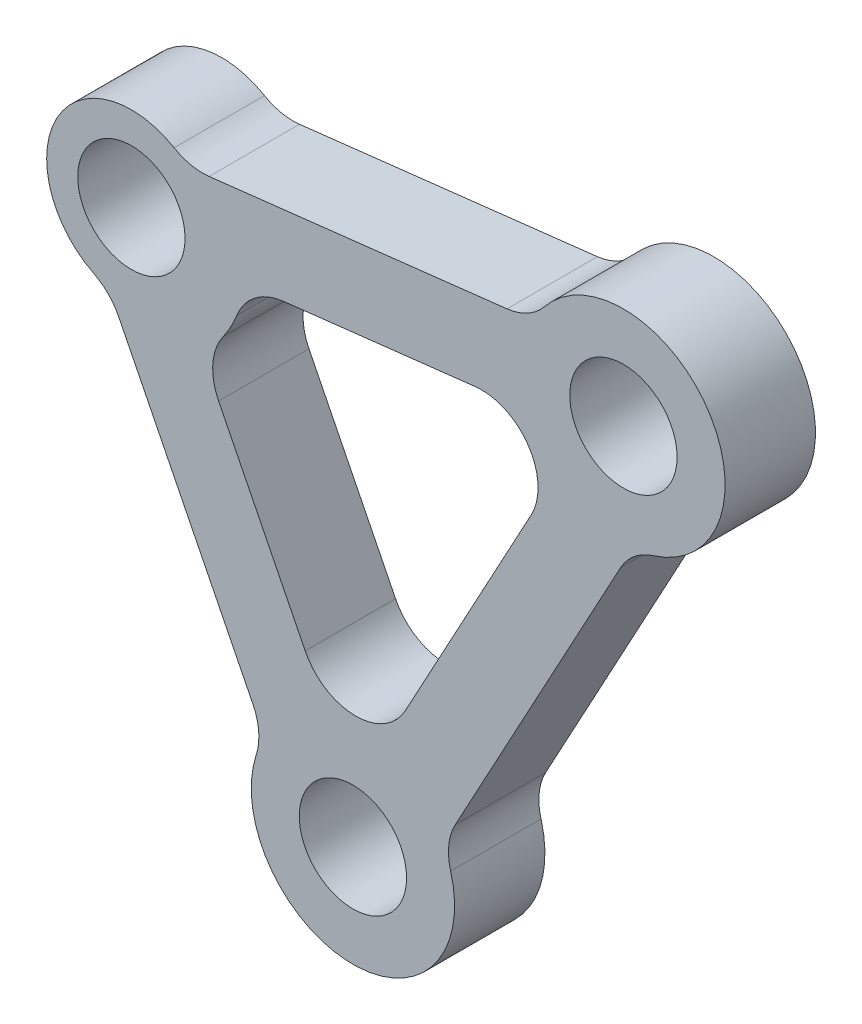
ISO-10303-21;
HEADER;
FILE_DESCRIPTION(('STEP AP214'),'2;1');
FILE_NAME('part.step','',(''),(''),'','','');
FILE_SCHEMA(('AUTOMOTIVE_DESIGN { 1 0 10303 214 1 1 1 1 }'));
ENDSEC;
DATA;
#1=APPLICATION_CONTEXT('core data for automotive mechanical design processes');
#2=APPLICATION_PROTOCOL_DEFINITION('international standard','automotive_design',2000,#1);
#3=PRODUCT_CONTEXT('',#1,'mechanical');
#4=PRODUCT('Part','Part','',(#3));
#5=PRODUCT_RELATED_PRODUCT_CATEGORY('part','',(#4));
#6=PRODUCT_DEFINITION_FORMATION('','',#4);
#7=PRODUCT_DEFINITION_CONTEXT('part definition',#1,'design');
#8=PRODUCT_DEFINITION('design','',#6,#7);
#9=PRODUCT_DEFINITION_SHAPE('','',#8);
#10=(LENGTH_UNIT() NAMED_UNIT(*) SI_UNIT(.MILLI.,.METRE.));
#11=(NAMED_UNIT(*) PLANE_ANGLE_UNIT() SI_UNIT($,.RADIAN.));
#12=(NAMED_UNIT(*) SI_UNIT($,.STERADIAN.) SOLID_ANGLE_UNIT());
#13=UNCERTAINTY_MEASURE_WITH_UNIT(LENGTH_MEASURE(1.E-05),#10,'distance_accuracy_value','');
#14=(GEOMETRIC_REPRESENTATION_CONTEXT(3) GLOBAL_UNCERTAINTY_ASSIGNED_CONTEXT((#13)) GLOBAL_UNIT_ASSIGNED_CONTEXT((#10,
#11,#12)) REPRESENTATION_CONTEXT('',''));
#15=CARTESIAN_POINT('',(0.,0.,0.));
#16=DIRECTION('',(0.,0.,1.));
#17=DIRECTION('',(1.,0.,0.));
#18=AXIS2_PLACEMENT_3D('',#15,#16,#17);
#19=CARTESIAN_POINT('',(24.01885053,220.145067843,29.));
#20=DIRECTION('',(0.11438469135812,-0.993436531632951,0.));
#21=DIRECTION('',(0.993436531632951,0.11438469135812,0.));
#22=AXIS2_PLACEMENT_3D('',#19,#20,#21);
#23=PLANE('',#22);
#24=DIRECTION('',(0.,0.,1.));
#25=VECTOR('',#24,1.);
#26=CARTESIAN_POINT('',(24.0188505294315,220.145067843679,33.));
#27=LINE('',#26,#25);
#28=CARTESIAN_POINT('',(24.0188505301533,220.14506784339,37.));
#29=VERTEX_POINT('',#28);
#30=CARTESIAN_POINT('',(24.018850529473,220.145067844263,29.));
#31=VERTEX_POINT('',#30);
#32=EDGE_CURVE('E309',#29,#31,#27,.F.);
#33=ORIENTED_EDGE('',*,*,#32,.F.);
#34=DIRECTION('',(0.993436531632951,0.11438469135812,0.));
#35=VECTOR('',#34,1.);
#36=CARTESIAN_POINT('',(24.01885053,220.145067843,37.));
#37=LINE('',#36,#35);
#38=CARTESIAN_POINT('',(50.3943201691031,223.181950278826,37.));
#39=VERTEX_POINT('',#38);
#40=EDGE_CURVE('E259',#29,#39,#37,.T.);
#41=ORIENTED_EDGE('',*,*,#40,.T.);
#42=DIRECTION('',(0.,0.,-1.));
#43=VECTOR('',#42,1.);
#44=CARTESIAN_POINT('',(50.3943201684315,223.181950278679,33.));
#45=LINE('',#44,#43);
#46=CARTESIAN_POINT('',(50.3943201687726,223.181950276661,29.));
#47=VERTEX_POINT('',#46);
#48=EDGE_CURVE('E203',#47,#39,#45,.F.);
#49=ORIENTED_EDGE('',*,*,#48,.F.);
#50=DIRECTION('',(0.993436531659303,0.114384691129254,0.));
#51=VECTOR('',#50,1.);
#52=CARTESIAN_POINT('',(24.018850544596,220.145067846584,29.));
#53=LINE('',#52,#51);
#54=EDGE_CURVE('E291',#31,#47,#53,.T.);
#55=ORIENTED_EDGE('',*,*,#54,.F.);
#56=EDGE_LOOP('',(#33,#41,#49,#55));
#57=FACE_BOUND('',#56,.T.);
#58=ADVANCED_FACE('F30',(#57),#23,.F.);
#59=CARTESIAN_POINT('',(49.822396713,228.149132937,37.));
#60=DIRECTION('',(0.,0.,-1.));
#61=DIRECTION('',(-1.,0.,0.));
#62=AXIS2_PLACEMENT_3D('',#59,#60,#61);
#63=CYLINDRICAL_SURFACE('',#62,5.);
#64=CARTESIAN_POINT('',(49.822396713,228.149132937,37.));
#65=DIRECTION('',(0.,0.,-1.));
#66=DIRECTION('',(-1.,0.,0.));
#67=AXIS2_PLACEMENT_3D('',#64,#65,#66);
#68=CIRCLE('',#67,5.);
#69=CARTESIAN_POINT('',(53.707217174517,225.001408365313,37.));
#70=VERTEX_POINT('',#69);
#71=EDGE_CURVE('E256',#39,#70,#68,.F.);
#72=ORIENTED_EDGE('',*,*,#71,.T.);
#73=DIRECTION('',(0.,0.,1.));
#74=VECTOR('',#73,1.);
#75=CARTESIAN_POINT('',(53.7072171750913,225.001408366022,33.));
#76=LINE('',#75,#74);
#77=CARTESIAN_POINT('',(53.7072171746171,225.001408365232,29.));
#78=VERTEX_POINT('',#77);
#79=EDGE_CURVE('E200',#70,#78,#76,.F.);
#80=ORIENTED_EDGE('',*,*,#79,.T.);
#81=CARTESIAN_POINT('',(49.822396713,228.149132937,29.));
#82=DIRECTION('',(0.,0.,-1.));
#83=DIRECTION('',(-1.,0.,0.));
#84=AXIS2_PLACEMENT_3D('',#81,#82,#83);
#85=CIRCLE('',#84,5.);
#86=EDGE_CURVE('E290',#47,#78,#85,.F.);
#87=ORIENTED_EDGE('',*,*,#86,.F.);
#88=ORIENTED_EDGE('',*,*,#48,.T.);
#89=EDGE_LOOP('',(#72,#80,#87,#88));
#90=FACE_BOUND('',#89,.T.);
#91=ADVANCED_FACE('F342',(#90),#63,.F.);
#92=CARTESIAN_POINT('',(60.699894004,219.335504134,37.));
#93=DIRECTION('',(0.,0.,-1.));
#94=DIRECTION('',(-1.,0.,0.));
#95=AXIS2_PLACEMENT_3D('',#92,#93,#94);
#96=CYLINDRICAL_SURFACE('',#95,8.99999999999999);
#97=ORIENTED_EDGE('',*,*,#79,.F.);
#98=CARTESIAN_POINT('',(60.699894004,219.335504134,37.));
#99=DIRECTION('',(0.,0.,-1.));
#100=DIRECTION('',(-1.,0.,0.));
#101=AXIS2_PLACEMENT_3D('',#98,#99,#100);
#102=CIRCLE('',#101,8.99999999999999);
#103=CARTESIAN_POINT('',(63.3541871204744,210.735810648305,37.));
#104=VERTEX_POINT('',#103);
#105=EDGE_CURVE('E253',#70,#104,#102,.T.);
#106=ORIENTED_EDGE('',*,*,#105,.T.);
#107=DIRECTION('',(0.,0.,-1.));
#108=VECTOR('',#107,1.);
#109=CARTESIAN_POINT('',(63.3541871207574,210.735810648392,33.));
#110=LINE('',#109,#108);
#111=CARTESIAN_POINT('',(63.3541871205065,210.7358106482,29.));
#112=VERTEX_POINT('',#111);
#113=EDGE_CURVE('E198',#112,#104,#110,.F.);
#114=ORIENTED_EDGE('',*,*,#113,.F.);
#115=CARTESIAN_POINT('',(60.699894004,219.335504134,29.));
#116=DIRECTION('',(0.,0.,-1.));
#117=DIRECTION('',(-1.,0.,0.));
#118=AXIS2_PLACEMENT_3D('',#115,#116,#117);
#119=CIRCLE('',#118,8.99999999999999);
#120=EDGE_CURVE('E288',#78,#112,#119,.T.);
#121=ORIENTED_EDGE('',*,*,#120,.F.);
#122=EDGE_LOOP('',(#97,#106,#114,#121));
#123=FACE_BOUND('',#122,.T.);
#124=ADVANCED_FACE('F347',(#123),#96,.T.);
#125=CARTESIAN_POINT('',(64.828794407,205.958203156,37.));
#126=DIRECTION('',(0.,0.,-1.));
#127=DIRECTION('',(-1.,0.,0.));
#128=AXIS2_PLACEMENT_3D('',#125,#126,#127);
#129=CYLINDRICAL_SURFACE('',#128,4.99999999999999);
#130=CARTESIAN_POINT('',(64.828794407,205.958203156,37.));
#131=DIRECTION('',(0.,0.,-1.));
#132=DIRECTION('',(-1.,0.,0.));
#133=AXIS2_PLACEMENT_3D('',#130,#131,#132);
#134=CIRCLE('',#133,4.99999999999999);
#135=CARTESIAN_POINT('',(60.4318747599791,208.338769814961,37.));
#136=VERTEX_POINT('',#135);
#137=EDGE_CURVE('E250',#104,#136,#134,.F.);
#138=ORIENTED_EDGE('',*,*,#137,.T.);
#139=DIRECTION('',(0.,0.,-1.));
#140=VECTOR('',#139,1.);
#141=CARTESIAN_POINT('',(60.43187476,208.338769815,33.));
#142=LINE('',#141,#140);
#143=CARTESIAN_POINT('',(60.4318747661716,208.338769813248,29.));
#144=VERTEX_POINT('',#143);
#145=EDGE_CURVE('E192',#136,#144,#142,.T.);
#146=ORIENTED_EDGE('',*,*,#145,.T.);
#147=CARTESIAN_POINT('',(64.828794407,205.958203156,29.));
#148=DIRECTION('',(0.,0.,-1.));
#149=DIRECTION('',(-1.,0.,0.));
#150=AXIS2_PLACEMENT_3D('',#147,#148,#149);
#151=CIRCLE('',#150,4.99999999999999);
#152=EDGE_CURVE('E286',#112,#144,#151,.F.);
#153=ORIENTED_EDGE('',*,*,#152,.F.);
#154=ORIENTED_EDGE('',*,*,#113,.T.);
#155=EDGE_LOOP('',(#138,#146,#153,#154));
#156=FACE_BOUND('',#155,.T.);
#157=ADVANCED_FACE('F350',(#156),#129,.F.);
#158=CARTESIAN_POINT('',(60.43187476,208.338769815,29.));
#159=DIRECTION('',(-0.879383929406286,0.476113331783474,0.));
#160=DIRECTION('',(-0.476113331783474,-0.879383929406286,0.));
#161=AXIS2_PLACEMENT_3D('',#158,#159,#160);
#162=PLANE('',#161);
#163=ORIENTED_EDGE('',*,*,#145,.F.);
#164=DIRECTION('',(-0.476113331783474,-0.879383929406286,0.));
#165=VECTOR('',#164,1.);
#166=CARTESIAN_POINT('',(60.43187476,208.338769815,37.));
#167=LINE('',#166,#165);
#168=CARTESIAN_POINT('',(45.813251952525,181.338093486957,37.));
#169=VERTEX_POINT('',#168);
#170=EDGE_CURVE('E247',#136,#169,#167,.T.);
#171=ORIENTED_EDGE('',*,*,#170,.T.);
#172=DIRECTION('',(0.,0.,-1.));
#173=VECTOR('',#172,1.);
#174=CARTESIAN_POINT('',(45.8132519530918,181.338093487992,33.));
#175=LINE('',#174,#173);
#176=CARTESIAN_POINT('',(45.8132519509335,181.338093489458,29.));
#177=VERTEX_POINT('',#176);
#178=EDGE_CURVE('E188',#177,#169,#175,.F.);
#179=ORIENTED_EDGE('',*,*,#178,.F.);
#180=DIRECTION('',(-0.476113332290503,-0.879383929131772,0.));
#181=VECTOR('',#180,1.);
#182=CARTESIAN_POINT('',(60.4318747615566,208.338769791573,29.));
#183=LINE('',#182,#181);
#184=EDGE_CURVE('E169',#144,#177,#183,.T.);
#185=ORIENTED_EDGE('',*,*,#184,.F.);
#186=EDGE_LOOP('',(#163,#171,#179,#185));
#187=FACE_BOUND('',#186,.T.);
#188=ADVANCED_FACE('F353',(#187),#162,.F.);
#189=CARTESIAN_POINT('',(50.210171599,178.957526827,37.));
#190=DIRECTION('',(0.,0.,-1.));
#191=DIRECTION('',(-1.,0.,0.));
#192=AXIS2_PLACEMENT_3D('',#189,#190,#191);
#193=CYLINDRICAL_SURFACE('',#192,5.);
#194=CARTESIAN_POINT('',(50.210171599,178.957526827,29.));
#195=DIRECTION('',(0.,0.,-1.));
#196=DIRECTION('',(-1.,0.,0.));
#197=AXIS2_PLACEMENT_3D('',#194,#195,#196);
#198=CIRCLE('',#197,5.);
#199=CARTESIAN_POINT('',(45.4034651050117,177.58072884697,29.));
#200=VERTEX_POINT('',#199);
#201=EDGE_CURVE('E162',#177,#200,#198,.F.);
#202=ORIENTED_EDGE('',*,*,#201,.F.);
#203=ORIENTED_EDGE('',*,*,#178,.T.);
#204=CARTESIAN_POINT('',(50.210171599,178.957526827,37.));
#205=DIRECTION('',(0.,0.,-1.));
#206=DIRECTION('',(-1.,0.,0.));
#207=AXIS2_PLACEMENT_3D('',#204,#205,#206);
#208=CIRCLE('',#207,5.);
#209=CARTESIAN_POINT('',(45.4034651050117,177.58072884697,37.));
#210=VERTEX_POINT('',#209);
#211=EDGE_CURVE('E186',#169,#210,#208,.F.);
#212=ORIENTED_EDGE('',*,*,#211,.T.);
#213=DIRECTION('',(0.,0.,1.));
#214=VECTOR('',#213,1.);
#215=CARTESIAN_POINT('',(45.4034651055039,177.580728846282,33.));
#216=LINE('',#215,#214);
#217=EDGE_CURVE('E178',#210,#200,#216,.F.);
#218=ORIENTED_EDGE('',*,*,#217,.T.);
#219=EDGE_LOOP('',(#202,#203,#212,#218));
#220=FACE_BOUND('',#219,.T.);
#221=ADVANCED_FACE('F184',(#220),#193,.F.);
#222=CARTESIAN_POINT('',(36.751393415,175.102492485,37.));
#223=DIRECTION('',(0.,0.,-1.));
#224=DIRECTION('',(-1.,0.,0.));
#225=AXIS2_PLACEMENT_3D('',#222,#223,#224);
#226=CYLINDRICAL_SURFACE('',#225,9.);
#227=CARTESIAN_POINT('',(36.751393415,175.102492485,37.));
#228=DIRECTION('',(0.,0.,-1.));
#229=DIRECTION('',(-1.,0.,0.));
#230=AXIS2_PLACEMENT_3D('',#227,#228,#229);
#231=CIRCLE('',#230,9.);
#232=CARTESIAN_POINT('',(28.1844969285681,177.860804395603,37.));
#233=VERTEX_POINT('',#232);
#234=EDGE_CURVE('E244',#210,#233,#231,.T.);
#235=ORIENTED_EDGE('',*,*,#234,.T.);
#236=DIRECTION('',(0.,0.,-1.));
#237=VECTOR('',#236,1.);
#238=CARTESIAN_POINT('',(28.1844969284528,177.860804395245,33.));
#239=LINE('',#238,#237);
#240=CARTESIAN_POINT('',(28.1844969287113,177.860804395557,29.));
#241=VERTEX_POINT('',#240);
#242=EDGE_CURVE('E179',#241,#233,#239,.F.);
#243=ORIENTED_EDGE('',*,*,#242,.F.);
#244=CARTESIAN_POINT('',(36.751393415,175.102492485,29.));
#245=DIRECTION('',(0.,0.,-1.));
#246=DIRECTION('',(-1.,0.,0.));
#247=AXIS2_PLACEMENT_3D('',#244,#245,#246);
#248=CIRCLE('',#247,9.);
#249=EDGE_CURVE('E166',#200,#241,#248,.T.);
#250=ORIENTED_EDGE('',*,*,#249,.F.);
#251=ORIENTED_EDGE('',*,*,#217,.F.);
#252=EDGE_LOOP('',(#235,#243,#250,#251));
#253=FACE_BOUND('',#252,.T.);
#254=ADVANCED_FACE('F177',(#253),#226,.T.);
#255=CARTESIAN_POINT('',(23.425109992,179.393199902,37.));
#256=DIRECTION('',(0.,0.,-1.));
#257=DIRECTION('',(-1.,0.,0.));
#258=AXIS2_PLACEMENT_3D('',#255,#256,#257);
#259=CYLINDRICAL_SURFACE('',#258,5.);
#260=CARTESIAN_POINT('',(23.425109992,179.393199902,37.));
#261=DIRECTION('',(0.,0.,-1.));
#262=DIRECTION('',(-1.,0.,0.));
#263=AXIS2_PLACEMENT_3D('',#260,#261,#262);
#264=CIRCLE('',#263,5.);
#265=CARTESIAN_POINT('',(27.897125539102,181.629508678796,37.));
#266=VERTEX_POINT('',#265);
#267=EDGE_CURVE('E241',#233,#266,#264,.F.);
#268=ORIENTED_EDGE('',*,*,#267,.T.);
#269=DIRECTION('',(0.,0.,-1.));
#270=VECTOR('',#269,1.);
#271=CARTESIAN_POINT('',(27.897125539,181.629508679,33.));
#272=LINE('',#271,#270);
#273=CARTESIAN_POINT('',(27.8971255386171,181.629508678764,29.));
#274=VERTEX_POINT('',#273);
#275=EDGE_CURVE('E190',#266,#274,#272,.T.);
#276=ORIENTED_EDGE('',*,*,#275,.T.);
#277=CARTESIAN_POINT('',(23.425109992,179.393199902,29.));
#278=DIRECTION('',(0.,0.,-1.));
#279=DIRECTION('',(-1.,0.,0.));
#280=AXIS2_PLACEMENT_3D('',#277,#278,#279);
#281=CIRCLE('',#280,5.);
#282=EDGE_CURVE('E181',#241,#274,#281,.F.);
#283=ORIENTED_EDGE('',*,*,#282,.F.);
#284=ORIENTED_EDGE('',*,*,#242,.T.);
#285=EDGE_LOOP('',(#268,#276,#283,#284));
#286=FACE_BOUND('',#285,.T.);
#287=ADVANCED_FACE('F318',(#286),#259,.F.);
#288=CARTESIAN_POINT('',(27.897125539,181.629508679,29.));
#289=DIRECTION('',(0.894403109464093,0.447261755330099,0.));
#290=DIRECTION('',(-0.447261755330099,0.894403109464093,0.));
#291=AXIS2_PLACEMENT_3D('',#288,#289,#290);
#292=PLANE('',#291);
#293=ORIENTED_EDGE('',*,*,#275,.F.);
#294=DIRECTION('',(-0.447261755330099,0.894403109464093,0.));
#295=VECTOR('',#294,1.);
#296=CARTESIAN_POINT('',(27.897125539,181.629508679,37.));
#297=LINE('',#296,#295);
#298=CARTESIAN_POINT('',(16.0224476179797,205.375667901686,37.));
#299=VERTEX_POINT('',#298);
#300=EDGE_CURVE('E238',#266,#299,#297,.T.);
#301=ORIENTED_EDGE('',*,*,#300,.T.);
#302=DIRECTION('',(0.,0.,-1.));
#303=VECTOR('',#302,1.);
#304=CARTESIAN_POINT('',(16.0224476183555,205.375667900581,33.));
#305=LINE('',#304,#303);
#306=CARTESIAN_POINT('',(16.0224476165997,205.375667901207,29.));
#307=VERTEX_POINT('',#306);
#308=EDGE_CURVE('E314',#307,#299,#305,.F.);
#309=ORIENTED_EDGE('',*,*,#308,.F.);
#310=DIRECTION('',(-0.447261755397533,0.894403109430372,0.));
#311=VECTOR('',#310,1.);
#312=CARTESIAN_POINT('',(27.8971255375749,181.629508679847,29.));
#313=LINE('',#312,#311);
#314=EDGE_CURVE('E282',#274,#307,#313,.T.);
#315=ORIENTED_EDGE('',*,*,#314,.F.);
#316=EDGE_LOOP('',(#293,#301,#309,#315));
#317=FACE_BOUND('',#316,.T.);
#318=ADVANCED_FACE('F323',(#317),#292,.F.);
#319=CARTESIAN_POINT('',(11.55043207,203.139359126,37.));
#320=DIRECTION('',(0.,0.,-1.));
#321=DIRECTION('',(-1.,0.,0.));
#322=AXIS2_PLACEMENT_3D('',#319,#320,#321);
#323=CYLINDRICAL_SURFACE('',#322,5.);
#324=CARTESIAN_POINT('',(11.55043207,203.139359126,37.));
#325=DIRECTION('',(0.,0.,-1.));
#326=DIRECTION('',(-1.,0.,0.));
#327=AXIS2_PLACEMENT_3D('',#324,#325,#326);
#328=CIRCLE('',#327,5.);
#329=CARTESIAN_POINT('',(13.7862592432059,207.611615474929,37.));
#330=VERTEX_POINT('',#329);
#331=EDGE_CURVE('E235',#299,#330,#328,.F.);
#332=ORIENTED_EDGE('',*,*,#331,.T.);
#333=DIRECTION('',(0.,0.,1.));
#334=VECTOR('',#333,1.);
#335=CARTESIAN_POINT('',(13.7862592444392,207.611615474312,33.));
#336=LINE('',#335,#334);
#337=CARTESIAN_POINT('',(13.7862592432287,207.611615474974,29.));
#338=VERTEX_POINT('',#337);
#339=EDGE_CURVE('E310',#330,#338,#336,.F.);
#340=ORIENTED_EDGE('',*,*,#339,.T.);
#341=CARTESIAN_POINT('',(11.55043207,203.139359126,29.));
#342=DIRECTION('',(0.,0.,-1.));
#343=DIRECTION('',(-1.,0.,0.));
#344=AXIS2_PLACEMENT_3D('',#341,#342,#343);
#345=CIRCLE('',#344,5.);
#346=EDGE_CURVE('E280',#307,#338,#345,.F.);
#347=ORIENTED_EDGE('',*,*,#346,.F.);
#348=ORIENTED_EDGE('',*,*,#308,.T.);
#349=EDGE_LOOP('',(#332,#340,#347,#348));
#350=FACE_BOUND('',#349,.T.);
#351=ADVANCED_FACE('F327',(#350),#323,.F.);
#352=CARTESIAN_POINT('',(17.14,214.32,37.));
#353=DIRECTION('',(0.,0.,-1.));
#354=DIRECTION('',(-1.,0.,0.));
#355=AXIS2_PLACEMENT_3D('',#352,#353,#354);
#356=CYLINDRICAL_SURFACE('',#355,7.5);
#357=CARTESIAN_POINT('',(17.14,214.32,37.));
#358=DIRECTION('',(0.,0.,-1.));
#359=DIRECTION('',(-1.,0.,0.));
#360=AXIS2_PLACEMENT_3D('',#357,#358,#359);
#361=CIRCLE('',#360,7.5);
#362=CARTESIAN_POINT('',(20.9241562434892,220.795350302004,37.));
#363=VERTEX_POINT('',#362);
#364=EDGE_CURVE('E232',#330,#363,#361,.T.);
#365=ORIENTED_EDGE('',*,*,#364,.T.);
#366=DIRECTION('',(0.,0.,-1.));
#367=VECTOR('',#366,1.);
#368=CARTESIAN_POINT('',(20.92415624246,220.795350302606,33.));
#369=LINE('',#368,#367);
#370=CARTESIAN_POINT('',(20.9241562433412,220.795350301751,29.));
#371=VERTEX_POINT('',#370);
#372=EDGE_CURVE('E307',#371,#363,#369,.F.);
#373=ORIENTED_EDGE('',*,*,#372,.F.);
#374=CARTESIAN_POINT('',(17.14,214.32,29.));
#375=DIRECTION('',(0.,0.,-1.));
#376=DIRECTION('',(-1.,0.,0.));
#377=AXIS2_PLACEMENT_3D('',#374,#375,#376);
#378=CIRCLE('',#377,7.5);
#379=EDGE_CURVE('E277',#338,#371,#378,.T.);
#380=ORIENTED_EDGE('',*,*,#379,.F.);
#381=ORIENTED_EDGE('',*,*,#339,.F.);
#382=EDGE_LOOP('',(#365,#373,#380,#381));
#383=FACE_BOUND('',#382,.T.);
#384=ADVANCED_FACE('F330',(#383),#356,.T.);
#385=CARTESIAN_POINT('',(23.446927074,225.112250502,37.));
#386=DIRECTION('',(0.,0.,-1.));
#387=DIRECTION('',(-1.,0.,0.));
#388=AXIS2_PLACEMENT_3D('',#385,#386,#387);
#389=CYLINDRICAL_SURFACE('',#388,5.);
#390=CARTESIAN_POINT('',(23.446927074,225.112250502,37.));
#391=DIRECTION('',(0.,0.,-1.));
#392=DIRECTION('',(-1.,0.,0.));
#393=AXIS2_PLACEMENT_3D('',#390,#391,#392);
#394=CIRCLE('',#393,5.);
#395=EDGE_CURVE('E229',#363,#29,#394,.F.);
#396=ORIENTED_EDGE('',*,*,#395,.T.);
#397=ORIENTED_EDGE('',*,*,#32,.T.);
#398=CARTESIAN_POINT('',(23.446927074,225.112250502,29.));
#399=DIRECTION('',(0.,0.,-1.));
#400=DIRECTION('',(-1.,0.,0.));
#401=AXIS2_PLACEMENT_3D('',#398,#399,#400);
#402=CIRCLE('',#401,5.);
#403=EDGE_CURVE('E34',#371,#31,#402,.F.);
#404=ORIENTED_EDGE('',*,*,#403,.F.);
#405=ORIENTED_EDGE('',*,*,#372,.T.);
#406=EDGE_LOOP('',(#396,#397,#404,#405));
#407=FACE_BOUND('',#406,.T.);
#408=ADVANCED_FACE('F333',(#407),#389,.F.);
#409=CARTESIAN_POINT('',(17.14,214.32,29.));
#410=DIRECTION('',(0.,0.,1.));
#411=DIRECTION('',(1.,0.,0.));
#412=AXIS2_PLACEMENT_3D('',#409,#410,#411);
#413=CYLINDRICAL_SURFACE('',#412,10.);
#414=DIRECTION('',(0.,0.,-1.));
#415=VECTOR('',#414,1.);
#416=CARTESIAN_POINT('',(25.2696129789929,208.496822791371,33.));
#417=LINE('',#416,#415);
#418=CARTESIAN_POINT('',(25.2696129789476,208.496822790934,29.));
#419=VERTEX_POINT('',#418);
#420=CARTESIAN_POINT('',(25.2696129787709,208.496822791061,37.));
#421=VERTEX_POINT('',#420);
#422=EDGE_CURVE('E305',#419,#421,#417,.F.);
#423=ORIENTED_EDGE('',*,*,#422,.F.);
#424=CARTESIAN_POINT('',(17.14,214.32,29.));
#425=DIRECTION('',(0.,0.,1.));
#426=DIRECTION('',(1.,0.,0.));
#427=AXIS2_PLACEMENT_3D('',#424,#425,#426);
#428=CIRCLE('',#427,10.);
#429=CARTESIAN_POINT('',(26.4600785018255,210.695619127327,29.));
#430=VERTEX_POINT('',#429);
#431=EDGE_CURVE('E272',#430,#419,#428,.F.);
#432=ORIENTED_EDGE('',*,*,#431,.F.);
#433=DIRECTION('',(0.,0.,1.));
#434=VECTOR('',#433,1.);
#435=CARTESIAN_POINT('',(26.4600785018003,210.695619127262,33.));
#436=LINE('',#435,#434);
#437=CARTESIAN_POINT('',(26.4600785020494,210.695619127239,37.));
#438=VERTEX_POINT('',#437);
#439=EDGE_CURVE('E295',#438,#430,#436,.F.);
#440=ORIENTED_EDGE('',*,*,#439,.F.);
#441=CARTESIAN_POINT('',(17.14,214.32,37.));
#442=DIRECTION('',(0.,0.,1.));
#443=DIRECTION('',(1.,0.,0.));
#444=AXIS2_PLACEMENT_3D('',#441,#442,#443);
#445=CIRCLE('',#444,10.);
#446=EDGE_CURVE('E223',#438,#421,#445,.F.);
#447=ORIENTED_EDGE('',*,*,#446,.T.);
#448=EDGE_LOOP('',(#423,#432,#440,#447));
#449=FACE_BOUND('',#448,.T.);
#450=ADVANCED_FACE('F400',(#449),#413,.T.);
#451=CARTESIAN_POINT('',(29.334419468,205.585234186,29.));
#452=DIRECTION('',(0.,0.,1.));
#453=DIRECTION('',(1.,0.,0.));
#454=AXIS2_PLACEMENT_3D('',#451,#452,#453);
#455=CYLINDRICAL_SURFACE('',#454,5.);
#456=CARTESIAN_POINT('',(29.334419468,205.585234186,29.));
#457=DIRECTION('',(0.,0.,1.));
#458=DIRECTION('',(1.,0.,0.));
#459=AXIS2_PLACEMENT_3D('',#456,#457,#458);
#460=CIRCLE('',#459,5.);
#461=CARTESIAN_POINT('',(24.8624039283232,203.348925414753,29.));
#462=VERTEX_POINT('',#461);
#463=EDGE_CURVE('E270',#419,#462,#460,.T.);
#464=ORIENTED_EDGE('',*,*,#463,.F.);
#465=ORIENTED_EDGE('',*,*,#422,.T.);
#466=CARTESIAN_POINT('',(29.334419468,205.585234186,37.));
#467=DIRECTION('',(0.,0.,1.));
#468=DIRECTION('',(1.,0.,0.));
#469=AXIS2_PLACEMENT_3D('',#466,#467,#468);
#470=CIRCLE('',#469,5.);
#471=CARTESIAN_POINT('',(24.862403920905,203.34892540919,37.));
#472=VERTEX_POINT('',#471);
#473=EDGE_CURVE('E220',#421,#472,#470,.T.);
#474=ORIENTED_EDGE('',*,*,#473,.T.);
#475=DIRECTION('',(0.,0.,-1.));
#476=VECTOR('',#475,1.);
#477=CARTESIAN_POINT('',(24.862403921,203.348925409,33.));
#478=LINE('',#477,#476);
#479=EDGE_CURVE('E431',#472,#462,#478,.T.);
#480=ORIENTED_EDGE('',*,*,#479,.T.);
#481=EDGE_LOOP('',(#464,#465,#474,#480));
#482=FACE_BOUND('',#481,.T.);
#483=ADVANCED_FACE('F403',(#482),#455,.F.);
#484=CARTESIAN_POINT('',(24.862403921,203.348925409,29.));
#485=DIRECTION('',(-0.894403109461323,-0.447261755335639,0.));
#486=DIRECTION('',(0.447261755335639,-0.894403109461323,0.));
#487=AXIS2_PLACEMENT_3D('',#484,#485,#486);
#488=PLANE('',#487);
#489=DIRECTION('',(0.,0.,-1.));
#490=VECTOR('',#489,1.);
#491=CARTESIAN_POINT('',(32.5259267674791,188.02394270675,33.));
#492=LINE('',#491,#490);
#493=CARTESIAN_POINT('',(32.5259267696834,188.023942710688,29.));
#494=VERTEX_POINT('',#493);
#495=CARTESIAN_POINT('',(32.5259267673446,188.023942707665,37.));
#496=VERTEX_POINT('',#495);
#497=EDGE_CURVE('E301',#494,#496,#492,.F.);
#498=ORIENTED_EDGE('',*,*,#497,.F.);
#499=DIRECTION('',(0.447261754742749,-0.894403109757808,0.));
#500=VECTOR('',#499,1.);
#501=CARTESIAN_POINT('',(24.8624039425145,203.348925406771,29.));
#502=LINE('',#501,#500);
#503=EDGE_CURVE('E268',#462,#494,#502,.T.);
#504=ORIENTED_EDGE('',*,*,#503,.F.);
#505=ORIENTED_EDGE('',*,*,#479,.F.);
#506=DIRECTION('',(0.447261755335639,-0.894403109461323,0.));
#507=VECTOR('',#506,1.);
#508=CARTESIAN_POINT('',(24.862403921,203.348925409,37.));
#509=LINE('',#508,#507);
#510=EDGE_CURVE('E217',#472,#496,#509,.T.);
#511=ORIENTED_EDGE('',*,*,#510,.T.);
#512=EDGE_LOOP('',(#498,#504,#505,#511));
#513=FACE_BOUND('',#512,.T.);
#514=ADVANCED_FACE('F406',(#513),#488,.F.);
#515=CARTESIAN_POINT('',(36.997942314,190.260251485,29.));
#516=DIRECTION('',(0.,0.,1.));
#517=DIRECTION('',(1.,0.,0.));
#518=AXIS2_PLACEMENT_3D('',#515,#516,#517);
#519=CYLINDRICAL_SURFACE('',#518,5.);
#520=CARTESIAN_POINT('',(36.997942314,190.260251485,29.));
#521=DIRECTION('',(0.,0.,1.));
#522=DIRECTION('',(1.,0.,0.));
#523=AXIS2_PLACEMENT_3D('',#520,#521,#522);
#524=CIRCLE('',#523,5.);
#525=CARTESIAN_POINT('',(41.3948619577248,187.879684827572,29.));
#526=VERTEX_POINT('',#525);
#527=EDGE_CURVE('E266',#494,#526,#524,.T.);
#528=ORIENTED_EDGE('',*,*,#527,.F.);
#529=ORIENTED_EDGE('',*,*,#497,.T.);
#530=CARTESIAN_POINT('',(36.997942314,190.260251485,37.));
#531=DIRECTION('',(0.,0.,1.));
#532=DIRECTION('',(1.,0.,0.));
#533=AXIS2_PLACEMENT_3D('',#530,#531,#532);
#534=CIRCLE('',#533,5.);
#535=CARTESIAN_POINT('',(41.3948619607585,187.879684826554,37.));
#536=VERTEX_POINT('',#535);
#537=EDGE_CURVE('E214',#496,#536,#534,.T.);
#538=ORIENTED_EDGE('',*,*,#537,.T.);
#539=DIRECTION('',(0.,0.,-1.));
#540=VECTOR('',#539,1.);
#541=CARTESIAN_POINT('',(41.394861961,187.879684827,33.));
#542=LINE('',#541,#540);
#543=EDGE_CURVE('E297',#536,#526,#542,.T.);
#544=ORIENTED_EDGE('',*,*,#543,.T.);
#545=EDGE_LOOP('',(#528,#529,#538,#544));
#546=FACE_BOUND('',#545,.T.);
#547=ADVANCED_FACE('F408',(#546),#519,.F.);
#548=CARTESIAN_POINT('',(41.394861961,187.879684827,29.));
#549=DIRECTION('',(0.879383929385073,-0.476113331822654,0.));
#550=DIRECTION('',(0.476113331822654,0.879383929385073,0.));
#551=AXIS2_PLACEMENT_3D('',#548,#549,#550);
#552=PLANE('',#551);
#553=DIRECTION('',(0.,0.,-1.));
#554=VECTOR('',#553,1.);
#555=CARTESIAN_POINT('',(52.5388897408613,208.462765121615,33.));
#556=LINE('',#555,#554);
#557=CARTESIAN_POINT('',(52.5388897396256,208.462765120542,29.));
#558=VERTEX_POINT('',#557);
#559=CARTESIAN_POINT('',(52.5388897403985,208.462765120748,37.));
#560=VERTEX_POINT('',#559);
#561=EDGE_CURVE('E262',#558,#560,#556,.F.);
#562=ORIENTED_EDGE('',*,*,#561,.F.);
#563=DIRECTION('',(0.47611333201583,0.879383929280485,0.));
#564=VECTOR('',#563,1.);
#565=CARTESIAN_POINT('',(41.3948619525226,187.879684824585,29.));
#566=LINE('',#565,#564);
#567=EDGE_CURVE('E263',#526,#558,#566,.T.);
#568=ORIENTED_EDGE('',*,*,#567,.F.);
#569=ORIENTED_EDGE('',*,*,#543,.F.);
#570=DIRECTION('',(0.476113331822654,0.879383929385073,0.));
#571=VECTOR('',#570,1.);
#572=CARTESIAN_POINT('',(41.394861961,187.879684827,37.));
#573=LINE('',#572,#571);
#574=EDGE_CURVE('E210',#536,#560,#573,.T.);
#575=ORIENTED_EDGE('',*,*,#574,.T.);
#576=EDGE_LOOP('',(#562,#568,#569,#575));
#577=FACE_BOUND('',#576,.T.);
#578=ADVANCED_FACE('F410',(#577),#552,.F.);
#579=CARTESIAN_POINT('',(31.120117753,208.883428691,29.));
#580=DIRECTION('',(0.,0.,1.));
#581=DIRECTION('',(1.,0.,0.));
#582=AXIS2_PLACEMENT_3D('',#579,#580,#581);
#583=CYLINDRICAL_SURFACE('',#582,5.);
#584=CARTESIAN_POINT('',(31.120117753,208.883428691,29.));
#585=DIRECTION('',(0.,0.,1.));
#586=DIRECTION('',(1.,0.,0.));
#587=AXIS2_PLACEMENT_3D('',#584,#585,#586);
#588=CIRCLE('',#587,5.);
#589=CARTESIAN_POINT('',(30.548194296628,213.850611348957,29.));
#590=VERTEX_POINT('',#589);
#591=EDGE_CURVE('E274',#590,#430,#588,.T.);
#592=ORIENTED_EDGE('',*,*,#591,.F.);
#593=DIRECTION('',(0.,0.,1.));
#594=VECTOR('',#593,1.);
#595=CARTESIAN_POINT('',(30.548194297,213.850611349,33.));
#596=LINE('',#595,#594);
#597=CARTESIAN_POINT('',(30.548194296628,213.850611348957,37.));
#598=VERTEX_POINT('',#597);
#599=EDGE_CURVE('E435',#590,#598,#596,.T.);
#600=ORIENTED_EDGE('',*,*,#599,.T.);
#601=CARTESIAN_POINT('',(31.120117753,208.883428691,37.));
#602=DIRECTION('',(0.,0.,1.));
#603=DIRECTION('',(1.,0.,0.));
#604=AXIS2_PLACEMENT_3D('',#601,#602,#603);
#605=CIRCLE('',#604,5.);
#606=EDGE_CURVE('E226',#598,#438,#605,.T.);
#607=ORIENTED_EDGE('',*,*,#606,.T.);
#608=ORIENTED_EDGE('',*,*,#439,.T.);
#609=EDGE_LOOP('',(#592,#600,#607,#608));
#610=FACE_BOUND('',#609,.T.);
#611=ADVANCED_FACE('F377',(#610),#583,.F.);
#612=CARTESIAN_POINT('',(70.060253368,165.729094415,29.));
#613=DIRECTION('',(0.,0.,-1.));
#614=DIRECTION('',(-1.,0.,0.));
#615=AXIS2_PLACEMENT_3D('',#612,#613,#614);
#616=PLANE('',#615);
#617=CARTESIAN_POINT('',(36.751393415,175.102492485,29.));
#618=DIRECTION('',(0.,0.,1.));
#619=DIRECTION('',(1.,0.,0.));
#620=AXIS2_PLACEMENT_3D('',#617,#618,#619);
#621=CIRCLE('',#620,4.75);
#622=CARTESIAN_POINT('',(41.501393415,175.102492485,29.));
#623=VERTEX_POINT('',#622);
#624=EDGE_CURVE('E452',#623,#623,#621,.T.);
#625=ORIENTED_EDGE('',*,*,#624,.T.);
#626=EDGE_LOOP('',(#625));
#627=FACE_BOUND('',#626,.T.);
#628=CARTESIAN_POINT('',(17.14,214.32,29.));
#629=DIRECTION('',(0.,0.,1.));
#630=DIRECTION('',(1.,0.,0.));
#631=AXIS2_PLACEMENT_3D('',#628,#629,#630);
#632=CIRCLE('',#631,4.75);
#633=CARTESIAN_POINT('',(21.89,214.32,29.));
#634=VERTEX_POINT('',#633);
#635=EDGE_CURVE('E446',#634,#634,#632,.T.);
#636=ORIENTED_EDGE('',*,*,#635,.T.);
#637=EDGE_LOOP('',(#636));
#638=FACE_BOUND('',#637,.T.);
#639=CARTESIAN_POINT('',(60.699894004,219.335504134,29.));
#640=DIRECTION('',(0.,0.,1.));
#641=DIRECTION('',(1.,0.,0.));
#642=AXIS2_PLACEMENT_3D('',#639,#640,#641);
#643=CIRCLE('',#642,4.75000000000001);
#644=CARTESIAN_POINT('',(65.449894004,219.335504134,29.));
#645=VERTEX_POINT('',#644);
#646=EDGE_CURVE('E205',#645,#645,#643,.T.);
#647=ORIENTED_EDGE('',*,*,#646,.T.);
#648=EDGE_LOOP('',(#647));
#649=FACE_BOUND('',#648,.T.);
#650=ORIENTED_EDGE('',*,*,#527,.T.);
#651=ORIENTED_EDGE('',*,*,#567,.T.);
#652=CARTESIAN_POINT('',(48.141970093,210.843331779,29.));
#653=DIRECTION('',(0.,0.,1.));
#654=DIRECTION('',(1.,0.,0.));
#655=AXIS2_PLACEMENT_3D('',#652,#653,#654);
#656=CIRCLE('',#655,5.);
#657=CARTESIAN_POINT('',(47.5700466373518,215.810514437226,29.));
#658=VERTEX_POINT('',#657);
#659=EDGE_CURVE('E207',#658,#558,#656,.F.);
#660=ORIENTED_EDGE('',*,*,#659,.F.);
#661=DIRECTION('',(-0.993436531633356,-0.114384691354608,0.));
#662=VECTOR('',#661,1.);
#663=CARTESIAN_POINT('',(39.0591204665,214.830562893,29.));
#664=LINE('',#663,#662);
#665=EDGE_CURVE('E213',#658,#590,#664,.T.);
#666=ORIENTED_EDGE('',*,*,#665,.T.);
#667=ORIENTED_EDGE('',*,*,#591,.T.);
#668=ORIENTED_EDGE('',*,*,#431,.T.);
#669=ORIENTED_EDGE('',*,*,#463,.T.);
#670=ORIENTED_EDGE('',*,*,#503,.T.);
#671=EDGE_LOOP('',(#650,#651,#660,#666,#667,#668,#669,#670));
#672=FACE_BOUND('',#671,.T.);
#673=ORIENTED_EDGE('',*,*,#346,.T.);
#674=ORIENTED_EDGE('',*,*,#379,.T.);
#675=ORIENTED_EDGE('',*,*,#403,.T.);
#676=ORIENTED_EDGE('',*,*,#54,.T.);
#677=ORIENTED_EDGE('',*,*,#86,.T.);
#678=ORIENTED_EDGE('',*,*,#120,.T.);
#679=ORIENTED_EDGE('',*,*,#152,.T.);
#680=ORIENTED_EDGE('',*,*,#184,.T.);
#681=ORIENTED_EDGE('',*,*,#201,.T.);
#682=ORIENTED_EDGE('',*,*,#249,.T.);
#683=ORIENTED_EDGE('',*,*,#282,.T.);
#684=ORIENTED_EDGE('',*,*,#314,.T.);
#685=EDGE_LOOP('',(#673,#674,#675,#676,#677,#678,#679,#680,#681,#682,#683,#684));
#686=FACE_BOUND('',#685,.T.);
#687=ADVANCED_FACE('F165',(#627,#638,#649,#672,#686),#616,.T.);
#688=CARTESIAN_POINT('',(70.060253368,165.729094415,37.));
#689=DIRECTION('',(0.,0.,-1.));
#690=DIRECTION('',(-1.,0.,0.));
#691=AXIS2_PLACEMENT_3D('',#688,#689,#690);
#692=PLANE('',#691);
#693=CARTESIAN_POINT('',(36.751393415,175.102492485,37.));
#694=DIRECTION('',(0.,0.,1.));
#695=DIRECTION('',(1.,0.,0.));
#696=AXIS2_PLACEMENT_3D('',#693,#694,#695);
#697=CIRCLE('',#696,4.75);
#698=CARTESIAN_POINT('',(41.501393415,175.102492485,37.));
#699=VERTEX_POINT('',#698);
#700=EDGE_CURVE('E455',#699,#699,#697,.T.);
#701=ORIENTED_EDGE('',*,*,#700,.F.);
#702=EDGE_LOOP('',(#701));
#703=FACE_BOUND('',#702,.T.);
#704=CARTESIAN_POINT('',(17.14,214.32,37.));
#705=DIRECTION('',(0.,0.,1.));
#706=DIRECTION('',(1.,0.,0.));
#707=AXIS2_PLACEMENT_3D('',#704,#705,#706);
#708=CIRCLE('',#707,4.75);
#709=CARTESIAN_POINT('',(21.89,214.32,37.));
#710=VERTEX_POINT('',#709);
#711=EDGE_CURVE('E449',#710,#710,#708,.T.);
#712=ORIENTED_EDGE('',*,*,#711,.F.);
#713=EDGE_LOOP('',(#712));
#714=FACE_BOUND('',#713,.T.);
#715=CARTESIAN_POINT('',(60.699894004,219.335504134,37.));
#716=DIRECTION('',(0.,0.,1.));
#717=DIRECTION('',(1.,0.,0.));
#718=AXIS2_PLACEMENT_3D('',#715,#716,#717);
#719=CIRCLE('',#718,4.75000000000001);
#720=CARTESIAN_POINT('',(65.449894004,219.335504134,37.));
#721=VERTEX_POINT('',#720);
#722=EDGE_CURVE('E443',#721,#721,#719,.T.);
#723=ORIENTED_EDGE('',*,*,#722,.F.);
#724=EDGE_LOOP('',(#723));
#725=FACE_BOUND('',#724,.T.);
#726=CARTESIAN_POINT('',(48.141970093,210.843331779,37.));
#727=DIRECTION('',(0.,0.,1.));
#728=DIRECTION('',(1.,0.,0.));
#729=AXIS2_PLACEMENT_3D('',#726,#727,#728);
#730=CIRCLE('',#729,5.);
#731=CARTESIAN_POINT('',(47.5700466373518,215.810514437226,37.));
#732=VERTEX_POINT('',#731);
#733=EDGE_CURVE('E40',#560,#732,#730,.T.);
#734=ORIENTED_EDGE('',*,*,#733,.F.);
#735=ORIENTED_EDGE('',*,*,#574,.F.);
#736=ORIENTED_EDGE('',*,*,#537,.F.);
#737=ORIENTED_EDGE('',*,*,#510,.F.);
#738=ORIENTED_EDGE('',*,*,#473,.F.);
#739=ORIENTED_EDGE('',*,*,#446,.F.);
#740=ORIENTED_EDGE('',*,*,#606,.F.);
#741=DIRECTION('',(0.993436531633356,0.114384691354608,0.));
#742=VECTOR('',#741,1.);
#743=CARTESIAN_POINT('',(39.0591204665,214.830562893,37.));
#744=LINE('',#743,#742);
#745=EDGE_CURVE('E209',#598,#732,#744,.T.);
#746=ORIENTED_EDGE('',*,*,#745,.T.);
#747=EDGE_LOOP('',(#734,#735,#736,#737,#738,#739,#740,#746));
#748=FACE_BOUND('',#747,.T.);
#749=ORIENTED_EDGE('',*,*,#364,.F.);
#750=ORIENTED_EDGE('',*,*,#331,.F.);
#751=ORIENTED_EDGE('',*,*,#300,.F.);
#752=ORIENTED_EDGE('',*,*,#267,.F.);
#753=ORIENTED_EDGE('',*,*,#234,.F.);
#754=ORIENTED_EDGE('',*,*,#211,.F.);
#755=ORIENTED_EDGE('',*,*,#170,.F.);
#756=ORIENTED_EDGE('',*,*,#137,.F.);
#757=ORIENTED_EDGE('',*,*,#105,.F.);
#758=ORIENTED_EDGE('',*,*,#71,.F.);
#759=ORIENTED_EDGE('',*,*,#40,.F.);
#760=ORIENTED_EDGE('',*,*,#395,.F.);
#761=EDGE_LOOP('',(#749,#750,#751,#752,#753,#754,#755,#756,#757,#758,#759,#760));
#762=FACE_BOUND('',#761,.T.);
#763=ADVANCED_FACE('F335',(#703,#714,#725,#748,#762),#692,.F.);
#764=CARTESIAN_POINT('',(47.570046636,215.810514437,29.));
#765=DIRECTION('',(-0.114384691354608,0.993436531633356,0.));
#766=DIRECTION('',(-0.993436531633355,-0.114384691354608,0.));
#767=AXIS2_PLACEMENT_3D('',#764,#765,#766);
#768=PLANE('',#767);
#769=ORIENTED_EDGE('',*,*,#599,.F.);
#770=ORIENTED_EDGE('',*,*,#665,.F.);
#771=DIRECTION('',(0.,0.,1.));
#772=VECTOR('',#771,1.);
#773=CARTESIAN_POINT('',(47.5700466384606,215.810514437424,33.));
#774=LINE('',#773,#772);
#775=EDGE_CURVE('E11',#732,#658,#774,.F.);
#776=ORIENTED_EDGE('',*,*,#775,.F.);
#777=ORIENTED_EDGE('',*,*,#745,.F.);
#778=EDGE_LOOP('',(#769,#770,#776,#777));
#779=FACE_BOUND('',#778,.T.);
#780=ADVANCED_FACE('F32',(#779),#768,.F.);
#781=CARTESIAN_POINT('',(48.141970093,210.843331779,29.));
#782=DIRECTION('',(0.,0.,1.));
#783=DIRECTION('',(1.,0.,0.));
#784=AXIS2_PLACEMENT_3D('',#781,#782,#783);
#785=CYLINDRICAL_SURFACE('',#784,5.);
#786=ORIENTED_EDGE('',*,*,#733,.T.);
#787=ORIENTED_EDGE('',*,*,#775,.T.);
#788=ORIENTED_EDGE('',*,*,#659,.T.);
#789=ORIENTED_EDGE('',*,*,#561,.T.);
#790=EDGE_LOOP('',(#786,#787,#788,#789));
#791=FACE_BOUND('',#790,.T.);
#792=ADVANCED_FACE('F364',(#791),#785,.F.);
#793=CARTESIAN_POINT('',(60.699894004,219.335504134,29.));
#794=DIRECTION('',(0.,0.,1.));
#795=DIRECTION('',(1.,0.,0.));
#796=AXIS2_PLACEMENT_3D('',#793,#794,#795);
#797=CYLINDRICAL_SURFACE('',#796,4.75000000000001);
#798=ORIENTED_EDGE('',*,*,#646,.F.);
#799=EDGE_LOOP('',(#798));
#800=FACE_BOUND('',#799,.T.);
#801=ORIENTED_EDGE('',*,*,#722,.T.);
#802=EDGE_LOOP('',(#801));
#803=FACE_BOUND('',#802,.T.);
#804=ADVANCED_FACE('F366',(#800,#803),#797,.F.);
#805=CARTESIAN_POINT('',(17.14,214.32,29.));
#806=DIRECTION('',(0.,0.,1.));
#807=DIRECTION('',(1.,0.,0.));
#808=AXIS2_PLACEMENT_3D('',#805,#806,#807);
#809=CYLINDRICAL_SURFACE('',#808,4.75);
#810=ORIENTED_EDGE('',*,*,#635,.F.);
#811=EDGE_LOOP('',(#810));
#812=FACE_BOUND('',#811,.T.);
#813=ORIENTED_EDGE('',*,*,#711,.T.);
#814=EDGE_LOOP('',(#813));
#815=FACE_BOUND('',#814,.T.);
#816=ADVANCED_FACE('F372',(#812,#815),#809,.F.);
#817=CARTESIAN_POINT('',(36.751393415,175.102492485,29.));
#818=DIRECTION('',(0.,0.,1.));
#819=DIRECTION('',(1.,0.,0.));
#820=AXIS2_PLACEMENT_3D('',#817,#818,#819);
#821=CYLINDRICAL_SURFACE('',#820,4.75);
#822=ORIENTED_EDGE('',*,*,#624,.F.);
#823=EDGE_LOOP('',(#822));
#824=FACE_BOUND('',#823,.T.);
#825=ORIENTED_EDGE('',*,*,#700,.T.);
#826=EDGE_LOOP('',(#825));
#827=FACE_BOUND('',#826,.T.);
#828=ADVANCED_FACE('F459',(#824,#827),#821,.F.);
#829=CLOSED_SHELL('',(#58,#91,#124,#157,#188,#221,#254,#287,#318,#351,#384,#408,#450,#483,#514,
#547,#578,#611,#687,#763,#780,#792,#804,#816,#828));
#830=MANIFOLD_SOLID_BREP('B2',#829);
#831=ADVANCED_BREP_SHAPE_REPRESENTATION('',(#18,#830),#14);
#832=SHAPE_DEFINITION_REPRESENTATION(#9,#831);
ENDSEC;
END-ISO-10303-21;
